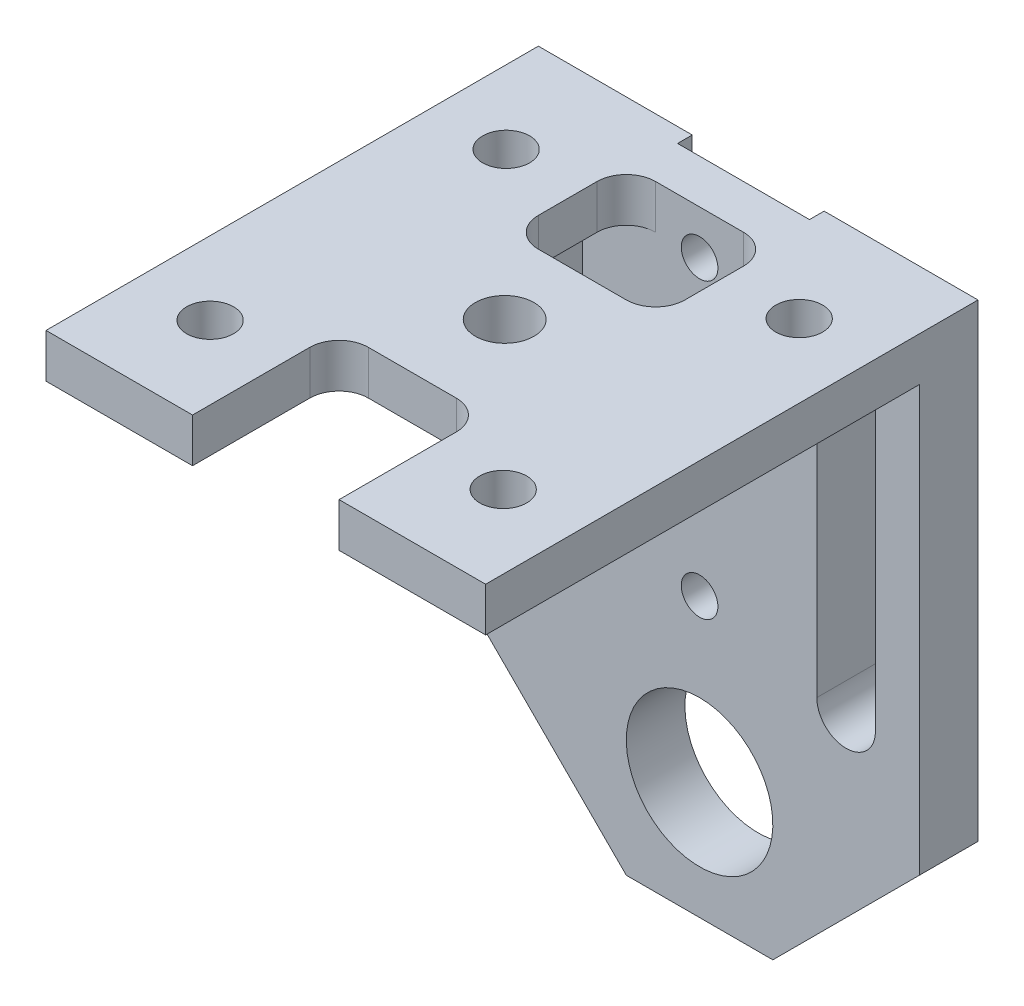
from build123d import *

# Parameters (mm, degrees)
EXTRUDE_1_DEPTH        = 30
SKETCH_2_R             = 5
CUT_EXTRUDE_2_DEPTH    = 30
SKETCH_3_R             = 1.6
CUT_EXTRUDE_3_DEPTH    = 4
CUT_EXTRUDE_5_REACH    = 63.587
SKETCH_19_W            = 9
SKETCH_19_H            = 28
CUT_EXTRUDE_6_DEPTH    = 1
HOLE_WIZARD_M3_2_D     = 2.5
HOLE_WIZARD_M3_2_DEPTH = 8.5
HOLE_WIZARD_M3_2_TIP   = 0.751075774
FILLET_5_R             = 2
CUT_EXTRUDE_8_REACH    = 61.582
FILLET_6_R             = 2
FILLET_7_R             = 2
CUT_EXTRUDE_10_DEPTH   = 10
CHAMFER_1_SIZE         = 10
HOLE_WIZARD_4_0_4_1_D  = 4


with BuildPart() as part:
    # Sketch 1 → Extrude 1 (new body)
    with BuildSketch(Plane(origin=(0, 0, 0), x_dir=(0, 0, -1), z_dir=(1, 0, 0))):
        Polygon((0, 0), (29.6, 0), (29.6, -39), (33.6, -39), (33.6, 3), (0, 3), align=None)
    extrude(amount=EXTRUDE_1_DEPTH)

    # Sketch 2 → Cut-Extrude 2 (cut)
    with BuildSketch(Plane(origin=(0, 0, -33.6), x_dir=(-1, 0, 0), z_dir=(0, 0, -1))):
        with Locations(Location((-15, -31, 0), (0, 0, 90))):
            Circle(SKETCH_2_R)
    extrude(amount=-CUT_EXTRUDE_2_DEPTH, mode=Mode.SUBTRACT)

    # Sketch 3 → Cut-Extrude 3 (cut)
    with BuildSketch(Plane(origin=(0, 3, 0), x_dir=(1, 0, 0), z_dir=(0, 1, 0))):
        with Locations(Location((25, 26.4, 0), (0, 0, 270))):
            Circle(SKETCH_3_R)
        with Locations(Location((25, 6.2, 0), (0, 0, 270))):
            Circle(SKETCH_3_R)
        with Locations(Location((5, 6.2, 0), (0, 0, 270))):
            Circle(SKETCH_3_R)
        with Locations(Location((5, 26.4, 0), (0, 0, 270))):
            Circle(SKETCH_3_R)
    extrude(amount=-CUT_EXTRUDE_3_DEPTH, mode=Mode.SUBTRACT)

    # Sketch 17 → Cut-Extrude 5 (cut, up to next)
    with BuildSketch(Plane(origin=(0, 3, 0), x_dir=(1, 0, 0), z_dir=(0, 1, 0)), mode=Mode.PRIVATE) as cut_extrude_5_sk1:
        Polygon((15, 0), (20, 0), (20, 10), (10, 10), (10, 0), align=None)
    cut_extrude_5_tool1 = extrude(cut_extrude_5_sk1.sketch, amount=-CUT_EXTRUDE_5_REACH, mode=Mode.PRIVATE) & part.part
    add(cut_extrude_5_tool1.solids().sort_by_distance((15, 3, -5))[0], mode=Mode.SUBTRACT)

    # Sketch 19 → Cut-Extrude 6 (cut)
    with BuildSketch(Plane(origin=(0, 0, -33.6), x_dir=(-1, 0, 0), z_dir=(0, 0, -1))):
        with Locations((-15, -11)):
            Rectangle(SKETCH_19_W, SKETCH_19_H)
    extrude(amount=-CUT_EXTRUDE_6_DEPTH, mode=Mode.SUBTRACT)

    # Hole Wizard M3 _2
    with Locations(Plane(origin=(0, 0, -32.6), x_dir=(-1, 0, 0), z_dir=(0, 0, -1))):
        with Locations((-15, -20), (-15, 0)):
            Hole(HOLE_WIZARD_M3_2_D / 2, depth=HOLE_WIZARD_M3_2_DEPTH)
            with Locations((0, 0, -(HOLE_WIZARD_M3_2_DEPTH + HOLE_WIZARD_M3_2_TIP / 2))):  # 118° drill point
                Cone(0, HOLE_WIZARD_M3_2_D / 2, HOLE_WIZARD_M3_2_TIP, mode=Mode.SUBTRACT)

    # Fillet 5
    fillet_5_edges = [part.edges().sort_by_distance(p)[0] for p in [
        (19.5, -25, -33.1),
        (10.5, -25, -33.1),
    ]]
    fillet(fillet_5_edges, radius=FILLET_5_R)

    # Sketch 27 → Cut-Extrude 8 (cut, up to next)
    with BuildSketch(Plane.XZ, mode=Mode.PRIVATE) as cut_extrude_8_sk1:
        Polygon((15, -21.6), (20, -21.6), (20, -29.6), (10, -29.6), (10, -21.6), align=None)
    cut_extrude_8_tool1 = extrude(cut_extrude_8_sk1.sketch, amount=-CUT_EXTRUDE_8_REACH, mode=Mode.PRIVATE) & part.part
    add(cut_extrude_8_tool1.solids().sort_by_distance((15, 0, -25.6))[0], mode=Mode.SUBTRACT)

    # Fillet 6
    fillet_6_edges = [part.edges().sort_by_distance(p)[0] for p in [
        (10, 1.5, -21.6),
        (20, 1.5, -21.6),
    ]]
    fillet(fillet_6_edges, radius=FILLET_6_R)

    # Fillet 7
    fillet_7_edges = [part.edges().sort_by_distance(p)[0] for p in [
        (20, 1.5, -29.6),
        (10, 1.5, -29.6),
        (10, 1.5, -10),
        (20, 1.5, -10),
    ]]
    fillet(fillet_7_edges, radius=FILLET_7_R)

    # Sketch 30 → Cut-Extrude 10 (cut)
    with BuildSketch(Plane(origin=(0, 0, -33.6), x_dir=(-1, 0, 0), z_dir=(0, 0, -1))):
        with BuildLine():
            Line((-27, -3), (-27, -22))
            ThreePointArc((-27, -22), (-25, -24), (-23, -22))
            Line((-23, -22), (-23, -3))
            ThreePointArc((-23, -3), (-25, -1), (-27, -3))
        make_face()
        with BuildLine():
            Line((-3, -3), (-3, -22))
            ThreePointArc((-3, -22), (-5, -24), (-7, -22))
            Line((-7, -22), (-7, -3))
            ThreePointArc((-7, -3), (-5, -1), (-3, -3))
        make_face()
    extrude(amount=-CUT_EXTRUDE_10_DEPTH, mode=Mode.SUBTRACT)

    # Chamfer 1
    chamfer_1_edges = [part.edges().sort_by_distance(p)[0] for p in [
        (30, -39, -31.6),
        (0, -39, -31.6),
    ]]
    chamfer(chamfer_1_edges, length=CHAMFER_1_SIZE)

    # Hole Wizard 4.0 _4_ _1 (through all)
    with Locations(Plane(origin=(15, 0, -16.3), x_dir=(0, 0, -1), z_dir=(0, -1, 0))):
        with Locations((0, 0)):
            Hole(HOLE_WIZARD_4_0_4_1_D / 2)


solid = part.part
